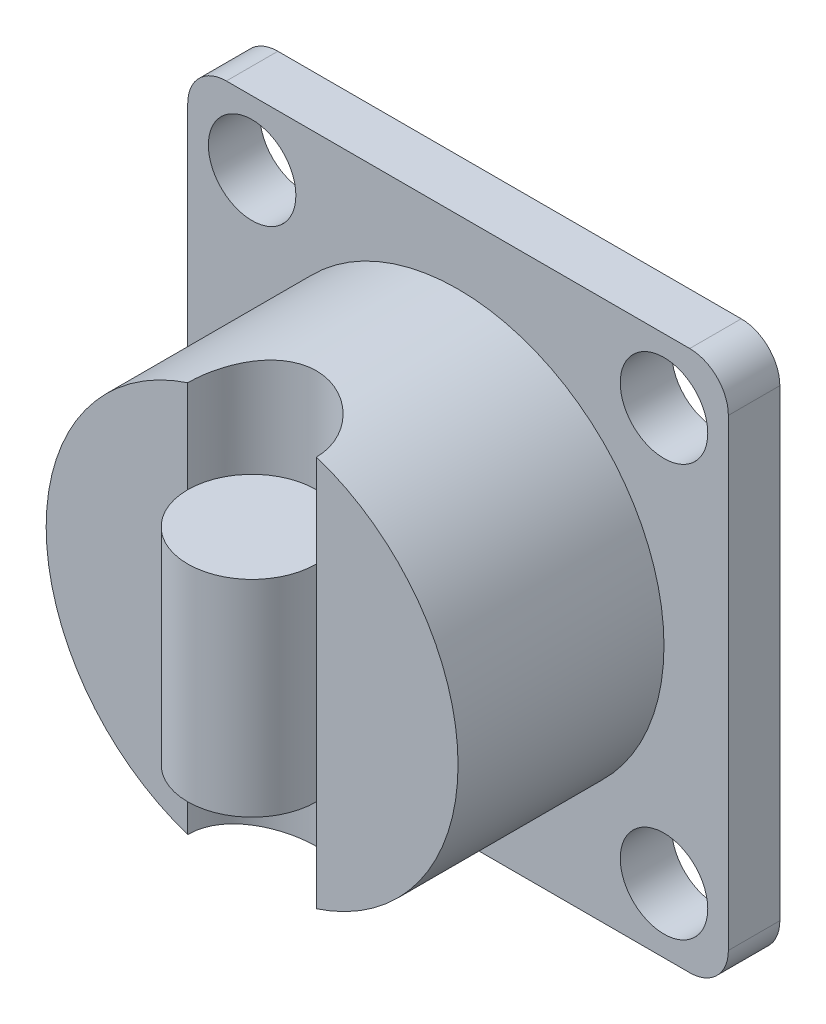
ISO-10303-21;
HEADER;
FILE_DESCRIPTION(('STEP AP214'),'2;1');
FILE_NAME('part.step','',(''),(''),'','','');
FILE_SCHEMA(('AUTOMOTIVE_DESIGN { 1 0 10303 214 1 1 1 1 }'));
ENDSEC;
DATA;
#1=APPLICATION_CONTEXT('core data for automotive mechanical design processes');
#2=APPLICATION_PROTOCOL_DEFINITION('international standard','automotive_design',2000,#1);
#3=PRODUCT_CONTEXT('',#1,'mechanical');
#4=PRODUCT('Part','Part','',(#3));
#5=PRODUCT_RELATED_PRODUCT_CATEGORY('part','',(#4));
#6=PRODUCT_DEFINITION_FORMATION('','',#4);
#7=PRODUCT_DEFINITION_CONTEXT('part definition',#1,'design');
#8=PRODUCT_DEFINITION('design','',#6,#7);
#9=PRODUCT_DEFINITION_SHAPE('','',#8);
#10=(LENGTH_UNIT() NAMED_UNIT(*) SI_UNIT(.MILLI.,.METRE.));
#11=(NAMED_UNIT(*) PLANE_ANGLE_UNIT() SI_UNIT($,.RADIAN.));
#12=(NAMED_UNIT(*) SI_UNIT($,.STERADIAN.) SOLID_ANGLE_UNIT());
#13=UNCERTAINTY_MEASURE_WITH_UNIT(LENGTH_MEASURE(1.E-05),#10,'distance_accuracy_value','');
#14=(GEOMETRIC_REPRESENTATION_CONTEXT(3) GLOBAL_UNCERTAINTY_ASSIGNED_CONTEXT((#13)) GLOBAL_UNIT_ASSIGNED_CONTEXT((#10,
#11,#12)) REPRESENTATION_CONTEXT('',''));
#15=CARTESIAN_POINT('',(0.,0.,0.));
#16=DIRECTION('',(0.,0.,1.));
#17=DIRECTION('',(1.,0.,0.));
#18=AXIS2_PLACEMENT_3D('',#15,#16,#17);
#19=CARTESIAN_POINT('',(-10.5,0.,10.));
#20=DIRECTION('',(0.,1.,0.));
#21=DIRECTION('',(0.,0.,1.));
#22=AXIS2_PLACEMENT_3D('',#19,#20,#21);
#23=CYLINDRICAL_SURFACE('',#22,2.5);
#24=CARTESIAN_POINT('',(-10.5,6.5,10.));
#25=DIRECTION('',(0.,1.,0.));
#26=DIRECTION('',(0.,0.,1.));
#27=AXIS2_PLACEMENT_3D('',#24,#25,#26);
#28=CIRCLE('',#27,2.5);
#29=CARTESIAN_POINT('',(-8.,6.5,10.));
#30=VERTEX_POINT('',#29);
#31=CARTESIAN_POINT('',(-13.,6.5,10.));
#32=VERTEX_POINT('',#31);
#33=EDGE_CURVE('E119',#30,#32,#28,.T.);
#34=ORIENTED_EDGE('',*,*,#33,.T.);
#35=DIRECTION('',(0.,1.,0.));
#36=VECTOR('',#35,1.);
#37=CARTESIAN_POINT('',(-13.,0.,10.));
#38=LINE('',#37,#36);
#39=CARTESIAN_POINT('',(-13.,2.90065792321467,10.));
#40=VERTEX_POINT('',#39);
#41=EDGE_CURVE('E357',#32,#40,#38,.F.);
#42=ORIENTED_EDGE('',*,*,#41,.T.);
#43=CARTESIAN_POINT('',(-8.,2.90065792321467,10.));
#44=CARTESIAN_POINT('',(-7.99999128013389,2.90066796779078,9.93153395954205));
#45=CARTESIAN_POINT('',(-8.0028123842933,2.89973289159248,9.86307361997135));
#46=CARTESIAN_POINT('',(-8.01404636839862,2.89604719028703,9.72667850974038));
#47=CARTESIAN_POINT('',(-8.02245790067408,2.89329700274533,9.65874361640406));
#48=CARTESIAN_POINT('',(-8.04477495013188,2.88606541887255,9.52406100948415));
#49=CARTESIAN_POINT('',(-8.05866566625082,2.88158868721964,9.45731059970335));
#50=CARTESIAN_POINT('',(-8.09180257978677,2.8710495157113,9.32529802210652));
#51=CARTESIAN_POINT('',(-8.11104893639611,2.86498702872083,9.26003589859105));
#52=CARTESIAN_POINT('',(-8.17657818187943,2.84468629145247,9.06721222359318));
#53=CARTESIAN_POINT('',(-8.23068165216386,2.82832427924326,8.94243194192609));
#54=CARTESIAN_POINT('',(-8.3580414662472,2.79179807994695,8.70371243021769));
#55=CARTESIAN_POINT('',(-8.43130776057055,2.77163191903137,8.58977887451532));
#56=CARTESIAN_POINT('',(-8.59760511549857,2.72899799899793,8.37205002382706));
#57=CARTESIAN_POINT('',(-8.69117779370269,2.70647831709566,8.2686777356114));
#58=CARTESIAN_POINT('',(-8.89427272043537,2.66211573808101,8.07880918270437));
#59=CARTESIAN_POINT('',(-9.00379770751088,2.64027295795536,7.99231582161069));
#60=CARTESIAN_POINT('',(-9.23875046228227,2.59912852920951,7.83677673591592));
#61=CARTESIAN_POINT('',(-9.36448192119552,2.57989554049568,7.76816995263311));
#62=CARTESIAN_POINT('',(-9.62639703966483,2.54674839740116,7.65324591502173));
#63=CARTESIAN_POINT('',(-9.76257781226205,2.53283278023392,7.60692252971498));
#64=CARTESIAN_POINT('',(-10.037069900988,2.51225658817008,7.53929811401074));
#65=CARTESIAN_POINT('',(-10.1751857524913,2.50538535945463,7.51726895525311));
#66=CARTESIAN_POINT('',(-10.4533155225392,2.49892807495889,7.4965512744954));
#67=CARTESIAN_POINT('',(-10.5933290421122,2.49934051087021,7.49785792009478));
#68=CARTESIAN_POINT('',(-10.86614973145,2.50725769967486,7.52329665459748));
#69=CARTESIAN_POINT('',(-10.9990387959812,2.51451706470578,7.54663902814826));
#70=CARTESIAN_POINT('',(-11.2589075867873,2.53501050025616,7.6141904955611));
#71=CARTESIAN_POINT('',(-11.3858869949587,2.54824489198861,7.65840071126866));
#72=CARTESIAN_POINT('',(-11.6321568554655,2.57953088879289,7.76694063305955));
#73=CARTESIAN_POINT('',(-11.7513340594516,2.59763952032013,7.83151017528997));
#74=CARTESIAN_POINT('',(-11.9774061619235,2.63676576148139,7.97874319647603));
#75=CARTESIAN_POINT('',(-12.0842980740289,2.6577840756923,8.06141106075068));
#76=CARTESIAN_POINT('',(-12.2874658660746,2.70152454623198,8.24653813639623));
#77=CARTESIAN_POINT('',(-12.383115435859,2.72428120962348,8.34967740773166));
#78=CARTESIAN_POINT('',(-12.5559653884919,2.76818377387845,8.57077031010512));
#79=CARTESIAN_POINT('',(-12.6331602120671,2.78932918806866,8.68872838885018));
#80=CARTESIAN_POINT('',(-12.767649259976,2.82779471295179,8.93790294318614));
#81=CARTESIAN_POINT('',(-12.8247002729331,2.84506721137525,9.06925830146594));
#82=CARTESIAN_POINT('',(-12.9156091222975,2.87326184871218,9.34031187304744));
#83=CARTESIAN_POINT('',(-12.9495027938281,2.88419379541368,9.47999683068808));
#84=CARTESIAN_POINT('',(-12.9807834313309,2.89435774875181,9.68417510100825));
#85=CARTESIAN_POINT('',(-12.9879880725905,2.89671458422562,9.74714493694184));
#86=CARTESIAN_POINT('',(-12.9975924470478,2.89986517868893,9.87339899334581));
#87=CARTESIAN_POINT('',(-12.9999989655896,2.90066114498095,9.93668264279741));
#88=CARTESIAN_POINT('',(-13.,2.90065792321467,10.));
#89=B_SPLINE_CURVE_WITH_KNOTS('',3,(#43,#44,#45,#46,#47,#48,#49,#50,#51,#52,#53,#54,#55,#56,#57,
#58,#59,#60,#61,#62,#63,#64,#65,#66,#67,#68,#69,#70,#71,#72,#73,#74,#75,#76,#77,#78,#79,#80,#81,
#82,#83,#84,#85,#86,#87,#88),.UNSPECIFIED.,.F.,.F.,(4,2,2,2,2,2,2,2,2,2,2,2,2,2,2,2,2,2,2,2,2,2,
4),(0.,0.205323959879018,0.410598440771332,0.615322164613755,0.820051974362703,1.22896577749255,
1.63809233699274,2.05988351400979,2.48174718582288,2.91315381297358,3.34444167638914,
3.7624189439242,4.18030965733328,4.58377069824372,4.98725343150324,5.39567896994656,
5.8042035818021,6.2297165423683,6.6553575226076,7.0859747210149,7.51592403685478,
7.70602799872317,7.89586293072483),.UNSPECIFIED.);
#90=CARTESIAN_POINT('',(-8.,2.90065792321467,10.));
#91=VERTEX_POINT('',#90);
#92=EDGE_CURVE('E122',#91,#40,#89,.T.);
#93=ORIENTED_EDGE('',*,*,#92,.F.);
#94=DIRECTION('',(0.,1.,0.));
#95=VECTOR('',#94,1.);
#96=CARTESIAN_POINT('',(-8.,0.,10.));
#97=LINE('',#96,#95);
#98=EDGE_CURVE('E116',#91,#30,#97,.T.);
#99=ORIENTED_EDGE('',*,*,#98,.T.);
#100=EDGE_LOOP('',(#34,#42,#93,#99));
#101=FACE_BOUND('',#100,.T.);
#102=ADVANCED_FACE('F26',(#101),#23,.F.);
#103=CARTESIAN_POINT('',(-10.5,10.5,10.));
#104=DIRECTION('',(0.,0.,1.));
#105=DIRECTION('',(1.,0.,0.));
#106=AXIS2_PLACEMENT_3D('',#103,#104,#105);
#107=PLANE('',#106);
#108=ORIENTED_EDGE('',*,*,#98,.F.);
#109=CARTESIAN_POINT('',(-10.5,10.5,10.));
#110=DIRECTION('',(0.,0.,1.));
#111=DIRECTION('',(1.,0.,0.));
#112=AXIS2_PLACEMENT_3D('',#109,#110,#111);
#113=CIRCLE('',#112,8.);
#114=CARTESIAN_POINT('',(-8.,18.0993420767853,10.));
#115=VERTEX_POINT('',#114);
#116=EDGE_CURVE('E394',#91,#115,#113,.T.);
#117=ORIENTED_EDGE('',*,*,#116,.T.);
#118=CARTESIAN_POINT('',(-8.,14.5,10.));
#119=VERTEX_POINT('',#118);
#120=EDGE_CURVE('E129',#119,#115,#97,.T.);
#121=ORIENTED_EDGE('',*,*,#120,.F.);
#122=EDGE_CURVE('E127',#30,#119,#97,.T.);
#123=ORIENTED_EDGE('',*,*,#122,.F.);
#124=EDGE_LOOP('',(#108,#117,#121,#123));
#125=FACE_BOUND('',#124,.T.);
#126=ADVANCED_FACE('F133',(#125),#107,.T.);
#127=CARTESIAN_POINT('',(-21.,0.,2.));
#128=DIRECTION('',(0.,0.,1.));
#129=DIRECTION('',(1.,0.,0.));
#130=AXIS2_PLACEMENT_3D('',#127,#128,#129);
#131=PLANE('',#130);
#132=CARTESIAN_POINT('',(-18.5,2.5,2.));
#133=DIRECTION('',(0.,0.,1.));
#134=DIRECTION('',(1.,0.,0.));
#135=AXIS2_PLACEMENT_3D('',#132,#133,#134);
#136=CIRCLE('',#135,1.69999999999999);
#137=CARTESIAN_POINT('',(-16.8,2.5,2.));
#138=VERTEX_POINT('',#137);
#139=EDGE_CURVE('E436',#138,#138,#136,.T.);
#140=ORIENTED_EDGE('',*,*,#139,.F.);
#141=EDGE_LOOP('',(#140));
#142=FACE_BOUND('',#141,.T.);
#143=CARTESIAN_POINT('',(-2.5,2.5,2.));
#144=DIRECTION('',(0.,0.,1.));
#145=DIRECTION('',(1.,0.,0.));
#146=AXIS2_PLACEMENT_3D('',#143,#144,#145);
#147=CIRCLE('',#146,1.69999999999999);
#148=CARTESIAN_POINT('',(-0.800000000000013,2.5,2.));
#149=VERTEX_POINT('',#148);
#150=EDGE_CURVE('E432',#149,#149,#147,.T.);
#151=ORIENTED_EDGE('',*,*,#150,.F.);
#152=EDGE_LOOP('',(#151));
#153=FACE_BOUND('',#152,.T.);
#154=CARTESIAN_POINT('',(-18.5,18.5,2.));
#155=DIRECTION('',(0.,0.,1.));
#156=DIRECTION('',(1.,0.,0.));
#157=AXIS2_PLACEMENT_3D('',#154,#155,#156);
#158=CIRCLE('',#157,1.69999999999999);
#159=CARTESIAN_POINT('',(-16.8,18.5,2.));
#160=VERTEX_POINT('',#159);
#161=EDGE_CURVE('E426',#160,#160,#158,.T.);
#162=ORIENTED_EDGE('',*,*,#161,.F.);
#163=EDGE_LOOP('',(#162));
#164=FACE_BOUND('',#163,.T.);
#165=CARTESIAN_POINT('',(-2.5,18.5,2.));
#166=DIRECTION('',(0.,0.,1.));
#167=DIRECTION('',(1.,0.,0.));
#168=AXIS2_PLACEMENT_3D('',#165,#166,#167);
#169=CIRCLE('',#168,1.69999999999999);
#170=CARTESIAN_POINT('',(-0.800000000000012,18.5,2.));
#171=VERTEX_POINT('',#170);
#172=EDGE_CURVE('E422',#171,#171,#169,.T.);
#173=ORIENTED_EDGE('',*,*,#172,.F.);
#174=EDGE_LOOP('',(#173));
#175=FACE_BOUND('',#174,.T.);
#176=DIRECTION('',(0.,-1.,0.));
#177=VECTOR('',#176,1.);
#178=CARTESIAN_POINT('',(-21.,21.,2.));
#179=LINE('',#178,#177);
#180=CARTESIAN_POINT('',(-21.,19.5,2.));
#181=VERTEX_POINT('',#180);
#182=CARTESIAN_POINT('',(-21.,1.50000000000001,2.));
#183=VERTEX_POINT('',#182);
#184=EDGE_CURVE('E359',#181,#183,#179,.T.);
#185=ORIENTED_EDGE('',*,*,#184,.T.);
#186=CARTESIAN_POINT('',(-19.5,1.5,2.));
#187=DIRECTION('',(0.,0.,1.));
#188=DIRECTION('',(1.,0.,0.));
#189=AXIS2_PLACEMENT_3D('',#186,#187,#188);
#190=CIRCLE('',#189,1.5);
#191=CARTESIAN_POINT('',(-19.5,0.,2.));
#192=VERTEX_POINT('',#191);
#193=EDGE_CURVE('E341',#183,#192,#190,.T.);
#194=ORIENTED_EDGE('',*,*,#193,.T.);
#195=DIRECTION('',(1.,0.,0.));
#196=VECTOR('',#195,1.);
#197=CARTESIAN_POINT('',(-21.,0.,2.));
#198=LINE('',#197,#196);
#199=CARTESIAN_POINT('',(-1.50000000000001,0.,2.));
#200=VERTEX_POINT('',#199);
#201=EDGE_CURVE('E355',#192,#200,#198,.T.);
#202=ORIENTED_EDGE('',*,*,#201,.T.);
#203=CARTESIAN_POINT('',(-1.5,1.5,2.));
#204=DIRECTION('',(0.,0.,1.));
#205=DIRECTION('',(1.,0.,0.));
#206=AXIS2_PLACEMENT_3D('',#203,#204,#205);
#207=CIRCLE('',#206,1.5);
#208=CARTESIAN_POINT('',(0.,1.50000000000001,2.));
#209=VERTEX_POINT('',#208);
#210=EDGE_CURVE('E331',#200,#209,#207,.T.);
#211=ORIENTED_EDGE('',*,*,#210,.T.);
#212=DIRECTION('',(0.,1.,0.));
#213=VECTOR('',#212,1.);
#214=CARTESIAN_POINT('',(0.,21.,2.));
#215=LINE('',#214,#213);
#216=CARTESIAN_POINT('',(0.,19.5,2.));
#217=VERTEX_POINT('',#216);
#218=EDGE_CURVE('E346',#209,#217,#215,.T.);
#219=ORIENTED_EDGE('',*,*,#218,.T.);
#220=CARTESIAN_POINT('',(-1.5,19.5,2.));
#221=DIRECTION('',(0.,0.,1.));
#222=DIRECTION('',(1.,0.,0.));
#223=AXIS2_PLACEMENT_3D('',#220,#221,#222);
#224=CIRCLE('',#223,1.5);
#225=CARTESIAN_POINT('',(-1.5,21.,2.));
#226=VERTEX_POINT('',#225);
#227=EDGE_CURVE('E48',#217,#226,#224,.T.);
#228=ORIENTED_EDGE('',*,*,#227,.T.);
#229=DIRECTION('',(-1.,0.,0.));
#230=VECTOR('',#229,1.);
#231=CARTESIAN_POINT('',(-21.,21.,2.));
#232=LINE('',#231,#230);
#233=CARTESIAN_POINT('',(-19.5,21.,2.));
#234=VERTEX_POINT('',#233);
#235=EDGE_CURVE('E354',#226,#234,#232,.T.);
#236=ORIENTED_EDGE('',*,*,#235,.T.);
#237=CARTESIAN_POINT('',(-19.5,19.5,2.));
#238=DIRECTION('',(0.,0.,1.));
#239=DIRECTION('',(1.,0.,0.));
#240=AXIS2_PLACEMENT_3D('',#237,#238,#239);
#241=CIRCLE('',#240,1.5);
#242=EDGE_CURVE('E334',#234,#181,#241,.T.);
#243=ORIENTED_EDGE('',*,*,#242,.T.);
#244=EDGE_LOOP('',(#185,#194,#202,#211,#219,#228,#236,#243));
#245=FACE_BOUND('',#244,.T.);
#246=CARTESIAN_POINT('',(-10.5,10.5,2.));
#247=DIRECTION('',(0.,0.,1.));
#248=DIRECTION('',(1.,0.,0.));
#249=AXIS2_PLACEMENT_3D('',#246,#247,#248);
#250=CIRCLE('',#249,8.);
#251=CARTESIAN_POINT('',(-2.5,10.5,2.));
#252=VERTEX_POINT('',#251);
#253=EDGE_CURVE('E403',#252,#252,#250,.T.);
#254=ORIENTED_EDGE('',*,*,#253,.F.);
#255=EDGE_LOOP('',(#254));
#256=FACE_BOUND('',#255,.T.);
#257=ADVANCED_FACE('F186',(#142,#153,#164,#175,#245,#256),#131,.T.);
#258=CARTESIAN_POINT('',(-21.,21.,2.));
#259=DIRECTION('',(1.,0.,0.));
#260=DIRECTION('',(0.,1.,0.));
#261=AXIS2_PLACEMENT_3D('',#258,#259,#260);
#262=PLANE('',#261);
#263=DIRECTION('',(0.,-1.,0.));
#264=VECTOR('',#263,1.);
#265=CARTESIAN_POINT('',(-21.,21.,0.));
#266=LINE('',#265,#264);
#267=CARTESIAN_POINT('',(-21.,19.5,0.));
#268=VERTEX_POINT('',#267);
#269=CARTESIAN_POINT('',(-21.,1.50000000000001,0.));
#270=VERTEX_POINT('',#269);
#271=EDGE_CURVE('E382',#268,#270,#266,.T.);
#272=ORIENTED_EDGE('',*,*,#271,.T.);
#273=DIRECTION('',(0.,0.,-1.));
#274=VECTOR('',#273,1.);
#275=CARTESIAN_POINT('',(-21.,1.5,2.));
#276=LINE('',#275,#274);
#277=EDGE_CURVE('E332',#270,#183,#276,.F.);
#278=ORIENTED_EDGE('',*,*,#277,.T.);
#279=ORIENTED_EDGE('',*,*,#184,.F.);
#280=DIRECTION('',(0.,0.,-1.));
#281=VECTOR('',#280,1.);
#282=CARTESIAN_POINT('',(-21.,19.5,2.));
#283=LINE('',#282,#281);
#284=EDGE_CURVE('E336',#181,#268,#283,.T.);
#285=ORIENTED_EDGE('',*,*,#284,.T.);
#286=EDGE_LOOP('',(#272,#278,#279,#285));
#287=FACE_BOUND('',#286,.T.);
#288=ADVANCED_FACE('F28',(#287),#262,.F.);
#289=CARTESIAN_POINT('',(-21.,0.,2.));
#290=DIRECTION('',(0.,1.,0.));
#291=DIRECTION('',(0.,0.,1.));
#292=AXIS2_PLACEMENT_3D('',#289,#290,#291);
#293=PLANE('',#292);
#294=ORIENTED_EDGE('',*,*,#201,.F.);
#295=DIRECTION('',(0.,0.,-1.));
#296=VECTOR('',#295,1.);
#297=CARTESIAN_POINT('',(-19.5,0.,2.));
#298=LINE('',#297,#296);
#299=CARTESIAN_POINT('',(-19.5,0.,0.));
#300=VERTEX_POINT('',#299);
#301=EDGE_CURVE('E367',#192,#300,#298,.T.);
#302=ORIENTED_EDGE('',*,*,#301,.T.);
#303=DIRECTION('',(1.,0.,0.));
#304=VECTOR('',#303,1.);
#305=CARTESIAN_POINT('',(-21.,0.,0.));
#306=LINE('',#305,#304);
#307=CARTESIAN_POINT('',(-1.50000000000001,0.,0.));
#308=VERTEX_POINT('',#307);
#309=EDGE_CURVE('E388',#300,#308,#306,.T.);
#310=ORIENTED_EDGE('',*,*,#309,.T.);
#311=DIRECTION('',(0.,0.,-1.));
#312=VECTOR('',#311,1.);
#313=CARTESIAN_POINT('',(-1.5,0.,2.));
#314=LINE('',#313,#312);
#315=EDGE_CURVE('E126',#308,#200,#314,.F.);
#316=ORIENTED_EDGE('',*,*,#315,.T.);
#317=EDGE_LOOP('',(#294,#302,#310,#316));
#318=FACE_BOUND('',#317,.T.);
#319=ADVANCED_FACE('F268',(#318),#293,.F.);
#320=CARTESIAN_POINT('',(0.,21.,2.));
#321=DIRECTION('',(-1.,0.,0.));
#322=DIRECTION('',(0.,-1.,0.));
#323=AXIS2_PLACEMENT_3D('',#320,#321,#322);
#324=PLANE('',#323);
#325=ORIENTED_EDGE('',*,*,#218,.F.);
#326=DIRECTION('',(0.,0.,-1.));
#327=VECTOR('',#326,1.);
#328=CARTESIAN_POINT('',(0.,1.5,2.));
#329=LINE('',#328,#327);
#330=CARTESIAN_POINT('',(0.,1.50000000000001,0.));
#331=VERTEX_POINT('',#330);
#332=EDGE_CURVE('E11',#209,#331,#329,.T.);
#333=ORIENTED_EDGE('',*,*,#332,.T.);
#334=DIRECTION('',(0.,1.,0.));
#335=VECTOR('',#334,1.);
#336=CARTESIAN_POINT('',(0.,21.,0.));
#337=LINE('',#336,#335);
#338=CARTESIAN_POINT('',(0.,19.5,0.));
#339=VERTEX_POINT('',#338);
#340=EDGE_CURVE('E349',#331,#339,#337,.T.);
#341=ORIENTED_EDGE('',*,*,#340,.T.);
#342=DIRECTION('',(0.,0.,-1.));
#343=VECTOR('',#342,1.);
#344=CARTESIAN_POINT('',(0.,19.5,2.));
#345=LINE('',#344,#343);
#346=EDGE_CURVE('E34',#339,#217,#345,.F.);
#347=ORIENTED_EDGE('',*,*,#346,.T.);
#348=EDGE_LOOP('',(#325,#333,#341,#347));
#349=FACE_BOUND('',#348,.T.);
#350=ADVANCED_FACE('F275',(#349),#324,.F.);
#351=CARTESIAN_POINT('',(-21.,21.,2.));
#352=DIRECTION('',(0.,-1.,0.));
#353=DIRECTION('',(0.,0.,-1.));
#354=AXIS2_PLACEMENT_3D('',#351,#352,#353);
#355=PLANE('',#354);
#356=DIRECTION('',(-1.,0.,0.));
#357=VECTOR('',#356,1.);
#358=CARTESIAN_POINT('',(-21.,21.,0.));
#359=LINE('',#358,#357);
#360=CARTESIAN_POINT('',(-1.5,21.,0.));
#361=VERTEX_POINT('',#360);
#362=CARTESIAN_POINT('',(-19.5,21.,0.));
#363=VERTEX_POINT('',#362);
#364=EDGE_CURVE('E398',#361,#363,#359,.T.);
#365=ORIENTED_EDGE('',*,*,#364,.T.);
#366=DIRECTION('',(0.,0.,-1.));
#367=VECTOR('',#366,1.);
#368=CARTESIAN_POINT('',(-19.5,21.,2.));
#369=LINE('',#368,#367);
#370=EDGE_CURVE('E41',#363,#234,#369,.F.);
#371=ORIENTED_EDGE('',*,*,#370,.T.);
#372=ORIENTED_EDGE('',*,*,#235,.F.);
#373=DIRECTION('',(0.,0.,-1.));
#374=VECTOR('',#373,1.);
#375=CARTESIAN_POINT('',(-1.5,21.,2.));
#376=LINE('',#375,#374);
#377=EDGE_CURVE('E330',#226,#361,#376,.T.);
#378=ORIENTED_EDGE('',*,*,#377,.T.);
#379=EDGE_LOOP('',(#365,#371,#372,#378));
#380=FACE_BOUND('',#379,.T.);
#381=ADVANCED_FACE('F282',(#380),#355,.F.);
#382=CARTESIAN_POINT('',(-21.,0.,0.));
#383=DIRECTION('',(0.,0.,1.));
#384=DIRECTION('',(1.,0.,0.));
#385=AXIS2_PLACEMENT_3D('',#382,#383,#384);
#386=PLANE('',#385);
#387=CARTESIAN_POINT('',(-18.5,2.5,0.));
#388=DIRECTION('',(0.,0.,1.));
#389=DIRECTION('',(1.,0.,0.));
#390=AXIS2_PLACEMENT_3D('',#387,#388,#389);
#391=CIRCLE('',#390,1.7);
#392=CARTESIAN_POINT('',(-16.8,2.5,0.));
#393=VERTEX_POINT('',#392);
#394=EDGE_CURVE('E411',#393,#393,#391,.T.);
#395=ORIENTED_EDGE('',*,*,#394,.T.);
#396=EDGE_LOOP('',(#395));
#397=FACE_BOUND('',#396,.T.);
#398=CARTESIAN_POINT('',(-2.5,2.5,0.));
#399=DIRECTION('',(0.,0.,1.));
#400=DIRECTION('',(1.,0.,0.));
#401=AXIS2_PLACEMENT_3D('',#398,#399,#400);
#402=CIRCLE('',#401,1.7);
#403=CARTESIAN_POINT('',(-0.800000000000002,2.5,0.));
#404=VERTEX_POINT('',#403);
#405=EDGE_CURVE('E415',#404,#404,#402,.T.);
#406=ORIENTED_EDGE('',*,*,#405,.T.);
#407=EDGE_LOOP('',(#406));
#408=FACE_BOUND('',#407,.T.);
#409=CARTESIAN_POINT('',(-18.5,18.5,0.));
#410=DIRECTION('',(0.,0.,1.));
#411=DIRECTION('',(1.,0.,0.));
#412=AXIS2_PLACEMENT_3D('',#409,#410,#411);
#413=CIRCLE('',#412,1.7);
#414=CARTESIAN_POINT('',(-16.8,18.5,0.));
#415=VERTEX_POINT('',#414);
#416=EDGE_CURVE('E419',#415,#415,#413,.T.);
#417=ORIENTED_EDGE('',*,*,#416,.T.);
#418=EDGE_LOOP('',(#417));
#419=FACE_BOUND('',#418,.T.);
#420=CARTESIAN_POINT('',(-2.5,18.5,0.));
#421=DIRECTION('',(0.,0.,1.));
#422=DIRECTION('',(1.,0.,0.));
#423=AXIS2_PLACEMENT_3D('',#420,#421,#422);
#424=CIRCLE('',#423,1.7);
#425=CARTESIAN_POINT('',(-0.800000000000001,18.5,0.));
#426=VERTEX_POINT('',#425);
#427=EDGE_CURVE('E143',#426,#426,#424,.T.);
#428=ORIENTED_EDGE('',*,*,#427,.T.);
#429=EDGE_LOOP('',(#428));
#430=FACE_BOUND('',#429,.T.);
#431=ORIENTED_EDGE('',*,*,#309,.F.);
#432=CARTESIAN_POINT('',(-19.5,1.5,0.));
#433=DIRECTION('',(0.,0.,1.));
#434=DIRECTION('',(1.,0.,0.));
#435=AXIS2_PLACEMENT_3D('',#432,#433,#434);
#436=CIRCLE('',#435,1.5);
#437=EDGE_CURVE('E376',#300,#270,#436,.F.);
#438=ORIENTED_EDGE('',*,*,#437,.T.);
#439=ORIENTED_EDGE('',*,*,#271,.F.);
#440=CARTESIAN_POINT('',(-19.5,19.5,0.));
#441=DIRECTION('',(0.,0.,1.));
#442=DIRECTION('',(1.,0.,0.));
#443=AXIS2_PLACEMENT_3D('',#440,#441,#442);
#444=CIRCLE('',#443,1.5);
#445=EDGE_CURVE('E374',#268,#363,#444,.F.);
#446=ORIENTED_EDGE('',*,*,#445,.T.);
#447=ORIENTED_EDGE('',*,*,#364,.F.);
#448=CARTESIAN_POINT('',(-1.5,19.5,0.));
#449=DIRECTION('',(0.,0.,1.));
#450=DIRECTION('',(1.,0.,0.));
#451=AXIS2_PLACEMENT_3D('',#448,#449,#450);
#452=CIRCLE('',#451,1.5);
#453=EDGE_CURVE('E370',#361,#339,#452,.F.);
#454=ORIENTED_EDGE('',*,*,#453,.T.);
#455=ORIENTED_EDGE('',*,*,#340,.F.);
#456=CARTESIAN_POINT('',(-1.5,1.5,0.));
#457=DIRECTION('',(0.,0.,1.));
#458=DIRECTION('',(1.,0.,0.));
#459=AXIS2_PLACEMENT_3D('',#456,#457,#458);
#460=CIRCLE('',#459,1.5);
#461=EDGE_CURVE('E372',#331,#308,#460,.F.);
#462=ORIENTED_EDGE('',*,*,#461,.T.);
#463=EDGE_LOOP('',(#431,#438,#439,#446,#447,#454,#455,#462));
#464=FACE_BOUND('',#463,.T.);
#465=ADVANCED_FACE('F183',(#397,#408,#419,#430,#464),#386,.F.);
#466=CARTESIAN_POINT('',(-10.5,10.5,10.));
#467=DIRECTION('',(0.,0.,-1.));
#468=DIRECTION('',(-1.,0.,0.));
#469=AXIS2_PLACEMENT_3D('',#466,#467,#468);
#470=CYLINDRICAL_SURFACE('',#469,8.);
#471=ORIENTED_EDGE('',*,*,#116,.F.);
#472=ORIENTED_EDGE('',*,*,#92,.T.);
#473=CARTESIAN_POINT('',(-13.,18.0993420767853,10.));
#474=VERTEX_POINT('',#473);
#475=EDGE_CURVE('E389',#474,#40,#113,.T.);
#476=ORIENTED_EDGE('',*,*,#475,.F.);
#477=CARTESIAN_POINT('',(-13.,18.0993420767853,10.));
#478=CARTESIAN_POINT('',(-13.0000087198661,18.0993320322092,9.93153395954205));
#479=CARTESIAN_POINT('',(-12.9971876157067,18.1002671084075,9.86307361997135));
#480=CARTESIAN_POINT('',(-12.9859536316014,18.103952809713,9.72667850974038));
#481=CARTESIAN_POINT('',(-12.9775420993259,18.1067029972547,9.65874361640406));
#482=CARTESIAN_POINT('',(-12.9552250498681,18.1139345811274,9.52406100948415));
#483=CARTESIAN_POINT('',(-12.9413343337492,18.1184113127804,9.45731059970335));
#484=CARTESIAN_POINT('',(-12.9081974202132,18.1289504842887,9.32529802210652));
#485=CARTESIAN_POINT('',(-12.8889510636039,18.1350129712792,9.26003589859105));
#486=CARTESIAN_POINT('',(-12.8234218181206,18.1553137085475,9.06721222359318));
#487=CARTESIAN_POINT('',(-12.7693183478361,18.1716757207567,8.94243194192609));
#488=CARTESIAN_POINT('',(-12.6419585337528,18.208201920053,8.70371243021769));
#489=CARTESIAN_POINT('',(-12.5686922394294,18.2283680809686,8.58977887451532));
#490=CARTESIAN_POINT('',(-12.4023948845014,18.2710020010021,8.37205002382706));
#491=CARTESIAN_POINT('',(-12.3088222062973,18.2935216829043,8.26867773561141));
#492=CARTESIAN_POINT('',(-12.1057272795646,18.337884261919,8.07880918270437));
#493=CARTESIAN_POINT('',(-11.9962022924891,18.3597270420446,7.99231582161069));
#494=CARTESIAN_POINT('',(-11.7612495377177,18.4008714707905,7.83677673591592));
#495=CARTESIAN_POINT('',(-11.6355180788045,18.4201044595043,7.76816995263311));
#496=CARTESIAN_POINT('',(-11.3736029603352,18.4532516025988,7.65324591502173));
#497=CARTESIAN_POINT('',(-11.2374221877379,18.4671672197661,7.60692252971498));
#498=CARTESIAN_POINT('',(-10.962930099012,18.4877434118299,7.53929811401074));
#499=CARTESIAN_POINT('',(-10.8248142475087,18.4946146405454,7.51726895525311));
#500=CARTESIAN_POINT('',(-10.5466844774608,18.5010719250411,7.4965512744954));
#501=CARTESIAN_POINT('',(-10.4066709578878,18.5006594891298,7.49785792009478));
#502=CARTESIAN_POINT('',(-10.13385026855,18.4927423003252,7.52329665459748));
#503=CARTESIAN_POINT('',(-10.0009612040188,18.4854829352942,7.54663902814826));
#504=CARTESIAN_POINT('',(-9.74109241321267,18.4649894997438,7.6141904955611));
#505=CARTESIAN_POINT('',(-9.61411300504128,18.4517551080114,7.65840071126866));
#506=CARTESIAN_POINT('',(-9.36784314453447,18.4204691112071,7.76694063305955));
#507=CARTESIAN_POINT('',(-9.2486659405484,18.4023604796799,7.83151017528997));
#508=CARTESIAN_POINT('',(-9.02259383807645,18.3632342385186,7.97874319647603));
#509=CARTESIAN_POINT('',(-8.91570192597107,18.3422159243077,8.06141106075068));
#510=CARTESIAN_POINT('',(-8.71253413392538,18.298475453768,8.24653813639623));
#511=CARTESIAN_POINT('',(-8.61688456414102,18.2757187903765,8.34967740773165));
#512=CARTESIAN_POINT('',(-8.44403461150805,18.2318162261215,8.57077031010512));
#513=CARTESIAN_POINT('',(-8.36683978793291,18.2106708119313,8.68872838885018));
#514=CARTESIAN_POINT('',(-8.23235074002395,18.1722052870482,8.93790294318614));
#515=CARTESIAN_POINT('',(-8.17529972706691,18.1549327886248,9.06925830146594));
#516=CARTESIAN_POINT('',(-8.08439087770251,18.1267381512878,9.34031187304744));
#517=CARTESIAN_POINT('',(-8.05049720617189,18.1158062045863,9.47999683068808));
#518=CARTESIAN_POINT('',(-8.01921656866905,18.1056422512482,9.68417510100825));
#519=CARTESIAN_POINT('',(-8.01201192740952,18.1032854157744,9.74714493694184));
#520=CARTESIAN_POINT('',(-8.00240755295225,18.1001348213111,9.87339899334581));
#521=CARTESIAN_POINT('',(-8.0000010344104,18.0993388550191,9.93668264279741));
#522=CARTESIAN_POINT('',(-8.,18.0993420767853,10.));
#523=B_SPLINE_CURVE_WITH_KNOTS('',3,(#477,#478,#479,#480,#481,#482,#483,#484,#485,#486,#487,
#488,#489,#490,#491,#492,#493,#494,#495,#496,#497,#498,#499,#500,#501,#502,#503,#504,#505,#506,
#507,#508,#509,#510,#511,#512,#513,#514,#515,#516,#517,#518,#519,#520,#521,#522),.UNSPECIFIED.,
.F.,.F.,(4,2,2,2,2,2,2,2,2,2,2,2,2,2,2,2,2,2,2,2,2,2,4),(0.,0.205323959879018,0.410598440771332,
0.615322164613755,0.820051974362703,1.22896577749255,1.63809233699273,2.05988351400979,
2.48174718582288,2.91315381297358,3.34444167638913,3.7624189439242,4.18030965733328,
4.58377069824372,4.98725343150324,5.39567896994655,5.80420358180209,6.2297165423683,
6.6553575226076,7.0859747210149,7.51592403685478,7.70602799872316,7.89586293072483),.UNSPECIFIED.);
#524=EDGE_CURVE('E153',#474,#115,#523,.T.);
#525=ORIENTED_EDGE('',*,*,#524,.T.);
#526=EDGE_LOOP('',(#471,#472,#476,#525));
#527=FACE_BOUND('',#526,.T.);
#528=ORIENTED_EDGE('',*,*,#253,.T.);
#529=EDGE_LOOP('',(#528));
#530=FACE_BOUND('',#529,.T.);
#531=ADVANCED_FACE('F165',(#527,#530),#470,.T.);
#532=CARTESIAN_POINT('',(-13.,14.5,10.));
#533=VERTEX_POINT('',#532);
#534=EDGE_CURVE('E363',#474,#533,#38,.F.);
#535=ORIENTED_EDGE('',*,*,#534,.F.);
#536=ORIENTED_EDGE('',*,*,#475,.T.);
#537=ORIENTED_EDGE('',*,*,#41,.F.);
#538=EDGE_CURVE('E141',#533,#32,#38,.F.);
#539=ORIENTED_EDGE('',*,*,#538,.F.);
#540=EDGE_LOOP('',(#535,#536,#537,#539));
#541=FACE_BOUND('',#540,.T.);
#542=ADVANCED_FACE('F173',(#541),#107,.T.);
#543=ORIENTED_EDGE('',*,*,#534,.T.);
#544=CARTESIAN_POINT('',(-10.5,14.5,10.));
#545=DIRECTION('',(0.,1.,0.));
#546=DIRECTION('',(0.,0.,1.));
#547=AXIS2_PLACEMENT_3D('',#544,#545,#546);
#548=CIRCLE('',#547,2.5);
#549=EDGE_CURVE('E147',#119,#533,#548,.T.);
#550=ORIENTED_EDGE('',*,*,#549,.F.);
#551=ORIENTED_EDGE('',*,*,#120,.T.);
#552=ORIENTED_EDGE('',*,*,#524,.F.);
#553=EDGE_LOOP('',(#543,#550,#551,#552));
#554=FACE_BOUND('',#553,.T.);
#555=ADVANCED_FACE('F169',(#554),#23,.F.);
#556=CARTESIAN_POINT('',(-10.5,14.5,10.));
#557=DIRECTION('',(0.,-1.,0.));
#558=DIRECTION('',(0.,0.,-1.));
#559=AXIS2_PLACEMENT_3D('',#556,#557,#558);
#560=CYLINDRICAL_SURFACE('',#559,2.5);
#561=ORIENTED_EDGE('',*,*,#122,.T.);
#562=EDGE_CURVE('E146',#533,#119,#548,.T.);
#563=ORIENTED_EDGE('',*,*,#562,.F.);
#564=ORIENTED_EDGE('',*,*,#538,.T.);
#565=EDGE_CURVE('E139',#32,#30,#28,.T.);
#566=ORIENTED_EDGE('',*,*,#565,.T.);
#567=EDGE_LOOP('',(#561,#563,#564,#566));
#568=FACE_BOUND('',#567,.T.);
#569=ADVANCED_FACE('F140',(#568),#560,.T.);
#570=CARTESIAN_POINT('',(-10.5,14.5,10.));
#571=DIRECTION('',(0.,1.,0.));
#572=DIRECTION('',(0.,0.,1.));
#573=AXIS2_PLACEMENT_3D('',#570,#571,#572);
#574=PLANE('',#573);
#575=ORIENTED_EDGE('',*,*,#549,.T.);
#576=ORIENTED_EDGE('',*,*,#562,.T.);
#577=EDGE_LOOP('',(#575,#576));
#578=FACE_BOUND('',#577,.T.);
#579=ADVANCED_FACE('F208',(#578),#574,.T.);
#580=CARTESIAN_POINT('',(-10.5,6.5,10.));
#581=DIRECTION('',(0.,1.,0.));
#582=DIRECTION('',(0.,0.,1.));
#583=AXIS2_PLACEMENT_3D('',#580,#581,#582);
#584=PLANE('',#583);
#585=ORIENTED_EDGE('',*,*,#33,.F.);
#586=ORIENTED_EDGE('',*,*,#565,.F.);
#587=EDGE_LOOP('',(#585,#586));
#588=FACE_BOUND('',#587,.T.);
#589=ADVANCED_FACE('F145',(#588),#584,.F.);
#590=CARTESIAN_POINT('',(-2.5,18.5,2.));
#591=DIRECTION('',(0.,0.,1.));
#592=DIRECTION('',(1.,0.,0.));
#593=AXIS2_PLACEMENT_3D('',#590,#591,#592);
#594=CYLINDRICAL_SURFACE('',#593,1.69999999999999);
#595=ORIENTED_EDGE('',*,*,#427,.F.);
#596=EDGE_LOOP('',(#595));
#597=FACE_BOUND('',#596,.T.);
#598=ORIENTED_EDGE('',*,*,#172,.T.);
#599=EDGE_LOOP('',(#598));
#600=FACE_BOUND('',#599,.T.);
#601=ADVANCED_FACE('F220',(#597,#600),#594,.F.);
#602=CARTESIAN_POINT('',(-18.5,18.5,2.));
#603=DIRECTION('',(0.,0.,1.));
#604=DIRECTION('',(1.,0.,0.));
#605=AXIS2_PLACEMENT_3D('',#602,#603,#604);
#606=CYLINDRICAL_SURFACE('',#605,1.69999999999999);
#607=ORIENTED_EDGE('',*,*,#416,.F.);
#608=EDGE_LOOP('',(#607));
#609=FACE_BOUND('',#608,.T.);
#610=ORIENTED_EDGE('',*,*,#161,.T.);
#611=EDGE_LOOP('',(#610));
#612=FACE_BOUND('',#611,.T.);
#613=ADVANCED_FACE('F227',(#609,#612),#606,.F.);
#614=CARTESIAN_POINT('',(-2.5,2.5,2.));
#615=DIRECTION('',(0.,0.,1.));
#616=DIRECTION('',(1.,0.,0.));
#617=AXIS2_PLACEMENT_3D('',#614,#615,#616);
#618=CYLINDRICAL_SURFACE('',#617,1.69999999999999);
#619=ORIENTED_EDGE('',*,*,#405,.F.);
#620=EDGE_LOOP('',(#619));
#621=FACE_BOUND('',#620,.T.);
#622=ORIENTED_EDGE('',*,*,#150,.T.);
#623=EDGE_LOOP('',(#622));
#624=FACE_BOUND('',#623,.T.);
#625=ADVANCED_FACE('F235',(#621,#624),#618,.F.);
#626=CARTESIAN_POINT('',(-18.5,2.5,2.));
#627=DIRECTION('',(0.,0.,1.));
#628=DIRECTION('',(1.,0.,0.));
#629=AXIS2_PLACEMENT_3D('',#626,#627,#628);
#630=CYLINDRICAL_SURFACE('',#629,1.69999999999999);
#631=ORIENTED_EDGE('',*,*,#394,.F.);
#632=EDGE_LOOP('',(#631));
#633=FACE_BOUND('',#632,.T.);
#634=ORIENTED_EDGE('',*,*,#139,.T.);
#635=EDGE_LOOP('',(#634));
#636=FACE_BOUND('',#635,.T.);
#637=ADVANCED_FACE('F243',(#633,#636),#630,.F.);
#638=CARTESIAN_POINT('',(-19.5,1.5,2.));
#639=DIRECTION('',(0.,0.,-1.));
#640=DIRECTION('',(-1.,0.,0.));
#641=AXIS2_PLACEMENT_3D('',#638,#639,#640);
#642=CYLINDRICAL_SURFACE('',#641,1.5);
#643=ORIENTED_EDGE('',*,*,#193,.F.);
#644=ORIENTED_EDGE('',*,*,#277,.F.);
#645=ORIENTED_EDGE('',*,*,#437,.F.);
#646=ORIENTED_EDGE('',*,*,#301,.F.);
#647=EDGE_LOOP('',(#643,#644,#645,#646));
#648=FACE_BOUND('',#647,.T.);
#649=ADVANCED_FACE('F251',(#648),#642,.T.);
#650=CARTESIAN_POINT('',(-19.5,19.5,2.));
#651=DIRECTION('',(0.,0.,-1.));
#652=DIRECTION('',(-1.,0.,0.));
#653=AXIS2_PLACEMENT_3D('',#650,#651,#652);
#654=CYLINDRICAL_SURFACE('',#653,1.5);
#655=ORIENTED_EDGE('',*,*,#242,.F.);
#656=ORIENTED_EDGE('',*,*,#370,.F.);
#657=ORIENTED_EDGE('',*,*,#445,.F.);
#658=ORIENTED_EDGE('',*,*,#284,.F.);
#659=EDGE_LOOP('',(#655,#656,#657,#658));
#660=FACE_BOUND('',#659,.T.);
#661=ADVANCED_FACE('F300',(#660),#654,.T.);
#662=CARTESIAN_POINT('',(-1.5,1.5,2.));
#663=DIRECTION('',(0.,0.,-1.));
#664=DIRECTION('',(-1.,0.,0.));
#665=AXIS2_PLACEMENT_3D('',#662,#663,#664);
#666=CYLINDRICAL_SURFACE('',#665,1.5);
#667=ORIENTED_EDGE('',*,*,#210,.F.);
#668=ORIENTED_EDGE('',*,*,#315,.F.);
#669=ORIENTED_EDGE('',*,*,#461,.F.);
#670=ORIENTED_EDGE('',*,*,#332,.F.);
#671=EDGE_LOOP('',(#667,#668,#669,#670));
#672=FACE_BOUND('',#671,.T.);
#673=ADVANCED_FACE('F308',(#672),#666,.T.);
#674=CARTESIAN_POINT('',(-1.5,19.5,2.));
#675=DIRECTION('',(0.,0.,-1.));
#676=DIRECTION('',(-1.,0.,0.));
#677=AXIS2_PLACEMENT_3D('',#674,#675,#676);
#678=CYLINDRICAL_SURFACE('',#677,1.5);
#679=ORIENTED_EDGE('',*,*,#227,.F.);
#680=ORIENTED_EDGE('',*,*,#346,.F.);
#681=ORIENTED_EDGE('',*,*,#453,.F.);
#682=ORIENTED_EDGE('',*,*,#377,.F.);
#683=EDGE_LOOP('',(#679,#680,#681,#682));
#684=FACE_BOUND('',#683,.T.);
#685=ADVANCED_FACE('F316',(#684),#678,.T.);
#686=CLOSED_SHELL('',(#102,#126,#257,#288,#319,#350,#381,#465,#531,#542,#555,#569,#579,#589,
#601,#613,#625,#637,#649,#661,#673,#685));
#687=MANIFOLD_SOLID_BREP('B2',#686);
#688=ADVANCED_BREP_SHAPE_REPRESENTATION('',(#18,#687),#14);
#689=SHAPE_DEFINITION_REPRESENTATION(#9,#688);
ENDSEC;
END-ISO-10303-21;
